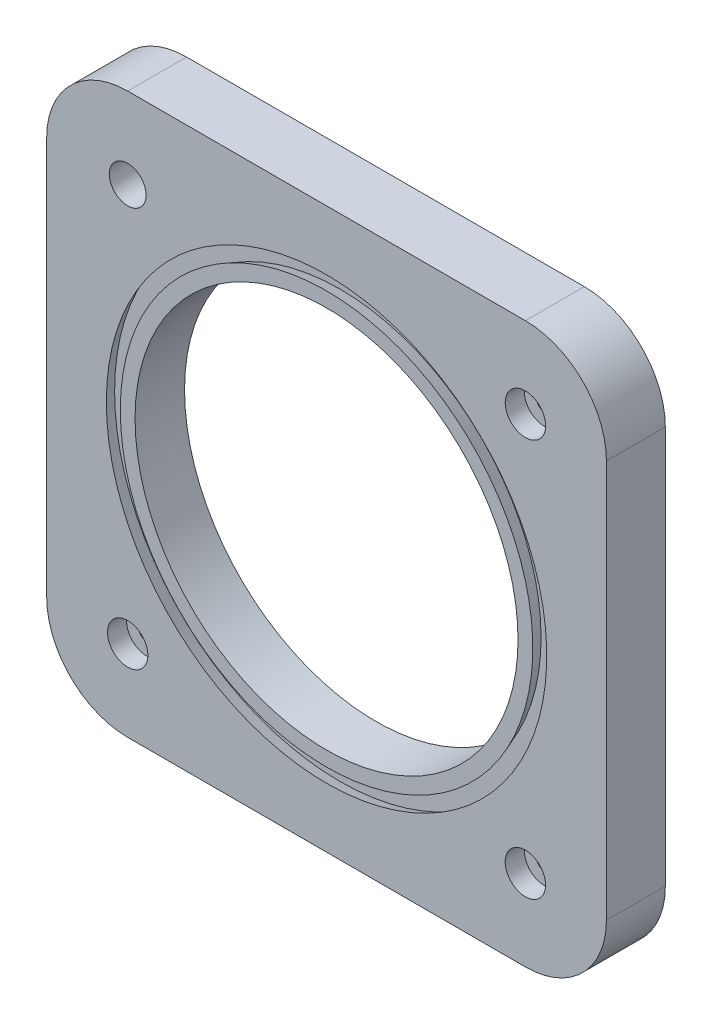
ISO-10303-21;
HEADER;
FILE_DESCRIPTION(('STEP AP214'),'2;1');
FILE_NAME('part.step','',(''),(''),'','','');
FILE_SCHEMA(('AUTOMOTIVE_DESIGN { 1 0 10303 214 1 1 1 1 }'));
ENDSEC;
DATA;
#1=APPLICATION_CONTEXT('core data for automotive mechanical design processes');
#2=APPLICATION_PROTOCOL_DEFINITION('international standard','automotive_design',2000,#1);
#3=PRODUCT_CONTEXT('',#1,'mechanical');
#4=PRODUCT('Part','Part','',(#3));
#5=PRODUCT_RELATED_PRODUCT_CATEGORY('part','',(#4));
#6=PRODUCT_DEFINITION_FORMATION('','',#4);
#7=PRODUCT_DEFINITION_CONTEXT('part definition',#1,'design');
#8=PRODUCT_DEFINITION('design','',#6,#7);
#9=PRODUCT_DEFINITION_SHAPE('','',#8);
#10=(LENGTH_UNIT() NAMED_UNIT(*) SI_UNIT(.MILLI.,.METRE.));
#11=(NAMED_UNIT(*) PLANE_ANGLE_UNIT() SI_UNIT($,.RADIAN.));
#12=(NAMED_UNIT(*) SI_UNIT($,.STERADIAN.) SOLID_ANGLE_UNIT());
#13=UNCERTAINTY_MEASURE_WITH_UNIT(LENGTH_MEASURE(1.E-05),#10,'distance_accuracy_value','');
#14=(GEOMETRIC_REPRESENTATION_CONTEXT(3) GLOBAL_UNCERTAINTY_ASSIGNED_CONTEXT((#13)) GLOBAL_UNIT_ASSIGNED_CONTEXT((#10,
#11,#12)) REPRESENTATION_CONTEXT('',''));
#15=CARTESIAN_POINT('',(0.,0.,0.));
#16=DIRECTION('',(0.,0.,1.));
#17=DIRECTION('',(1.,0.,0.));
#18=AXIS2_PLACEMENT_3D('',#15,#16,#17);
#19=CARTESIAN_POINT('',(0.,0.,25.4));
#20=DIRECTION('',(0.,0.,-1.));
#21=DIRECTION('',(-1.,0.,0.));
#22=AXIS2_PLACEMENT_3D('',#19,#20,#21);
#23=CYLINDRICAL_SURFACE('',#22,82.55);
#24=CARTESIAN_POINT('',(0.,0.,25.4));
#25=DIRECTION('',(0.,0.,1.));
#26=DIRECTION('',(1.,0.,0.));
#27=AXIS2_PLACEMENT_3D('',#24,#25,#26);
#28=CIRCLE('',#27,82.55);
#29=CARTESIAN_POINT('',(-82.55,0.,25.4));
#30=VERTEX_POINT('',#29);
#31=EDGE_CURVE('E122',#30,#30,#28,.T.);
#32=CARTESIAN_POINT('',(0.,0.,4.064));
#33=DIRECTION('',(0.,0.,-1.));
#34=DIRECTION('',(-1.,0.,0.));
#35=AXIS2_PLACEMENT_3D('',#32,#33,#34);
#36=CIRCLE('',#35,82.55);
#37=CARTESIAN_POINT('',(-82.55,0.,4.06400000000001));
#38=VERTEX_POINT('',#37);
#39=EDGE_CURVE('E38',#38,#38,#36,.T.);
#40=CARTESIAN_POINT('',(-82.55,0.,25.4));
#41=CARTESIAN_POINT('',(-82.55,0.,25.17775));
#42=CARTESIAN_POINT('',(-82.55,0.,24.9555));
#43=CARTESIAN_POINT('',(-82.55,0.,24.511));
#44=CARTESIAN_POINT('',(-82.55,0.,24.28875));
#45=CARTESIAN_POINT('',(-82.55,0.,23.84425));
#46=CARTESIAN_POINT('',(-82.55,0.,23.622));
#47=CARTESIAN_POINT('',(-82.55,0.,23.1775));
#48=CARTESIAN_POINT('',(-82.55,0.,22.95525));
#49=CARTESIAN_POINT('',(-82.55,0.,22.51075));
#50=CARTESIAN_POINT('',(-82.55,0.,22.2885));
#51=CARTESIAN_POINT('',(-82.55,0.,21.844));
#52=CARTESIAN_POINT('',(-82.55,0.,21.62175));
#53=CARTESIAN_POINT('',(-82.55,0.,21.17725));
#54=CARTESIAN_POINT('',(-82.55,0.,20.955));
#55=CARTESIAN_POINT('',(-82.55,0.,20.5105));
#56=CARTESIAN_POINT('',(-82.55,0.,20.28825));
#57=CARTESIAN_POINT('',(-82.55,0.,19.84375));
#58=CARTESIAN_POINT('',(-82.55,0.,19.6215));
#59=CARTESIAN_POINT('',(-82.55,0.,19.177));
#60=CARTESIAN_POINT('',(-82.55,0.,18.95475));
#61=CARTESIAN_POINT('',(-82.55,0.,18.51025));
#62=CARTESIAN_POINT('',(-82.55,0.,18.288));
#63=CARTESIAN_POINT('',(-82.55,0.,17.8435));
#64=CARTESIAN_POINT('',(-82.55,0.,17.62125));
#65=CARTESIAN_POINT('',(-82.55,0.,17.17675));
#66=CARTESIAN_POINT('',(-82.55,0.,16.9545));
#67=CARTESIAN_POINT('',(-82.55,0.,16.51));
#68=CARTESIAN_POINT('',(-82.55,0.,16.28775));
#69=CARTESIAN_POINT('',(-82.55,0.,15.84325));
#70=CARTESIAN_POINT('',(-82.55,0.,15.621));
#71=CARTESIAN_POINT('',(-82.55,0.,15.1765));
#72=CARTESIAN_POINT('',(-82.55,0.,14.95425));
#73=CARTESIAN_POINT('',(-82.55,0.,14.50975));
#74=CARTESIAN_POINT('',(-82.55,0.,14.2875));
#75=CARTESIAN_POINT('',(-82.55,0.,13.843));
#76=CARTESIAN_POINT('',(-82.55,0.,13.62075));
#77=CARTESIAN_POINT('',(-82.55,0.,13.17625));
#78=CARTESIAN_POINT('',(-82.55,0.,12.954));
#79=CARTESIAN_POINT('',(-82.55,0.,12.5095));
#80=CARTESIAN_POINT('',(-82.55,0.,12.28725));
#81=CARTESIAN_POINT('',(-82.55,0.,11.84275));
#82=CARTESIAN_POINT('',(-82.55,0.,11.6205));
#83=CARTESIAN_POINT('',(-82.55,0.,11.176));
#84=CARTESIAN_POINT('',(-82.55,0.,10.95375));
#85=CARTESIAN_POINT('',(-82.55,0.,10.50925));
#86=CARTESIAN_POINT('',(-82.55,0.,10.287));
#87=CARTESIAN_POINT('',(-82.55,0.,9.8425));
#88=CARTESIAN_POINT('',(-82.55,0.,9.62025));
#89=CARTESIAN_POINT('',(-82.55,0.,9.17575));
#90=CARTESIAN_POINT('',(-82.55,0.,8.9535));
#91=CARTESIAN_POINT('',(-82.55,0.,8.509));
#92=CARTESIAN_POINT('',(-82.55,0.,8.28675));
#93=CARTESIAN_POINT('',(-82.55,0.,7.84225000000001));
#94=CARTESIAN_POINT('',(-82.55,0.,7.62000000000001));
#95=CARTESIAN_POINT('',(-82.55,0.,7.1755));
#96=CARTESIAN_POINT('',(-82.55,0.,6.95325));
#97=CARTESIAN_POINT('',(-82.55,0.,6.50875));
#98=CARTESIAN_POINT('',(-82.55,0.,6.2865));
#99=CARTESIAN_POINT('',(-82.55,0.,5.842));
#100=CARTESIAN_POINT('',(-82.55,0.,5.61975000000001));
#101=CARTESIAN_POINT('',(-82.55,0.,5.17525000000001));
#102=CARTESIAN_POINT('',(-82.55,0.,4.95300000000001));
#103=CARTESIAN_POINT('',(-82.55,0.,4.50850000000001));
#104=CARTESIAN_POINT('',(-82.55,0.,4.28625000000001));
#105=CARTESIAN_POINT('',(-82.55,0.,4.06400000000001));
#106=B_SPLINE_CURVE_WITH_KNOTS('',3,(#40,#41,#42,#43,#44,#45,#46,#47,#48,#49,#50,#51,#52,#53,
#54,#55,#56,#57,#58,#59,#60,#61,#62,#63,#64,#65,#66,#67,#68,#69,#70,#71,#72,#73,#74,#75,#76,#77,
#78,#79,#80,#81,#82,#83,#84,#85,#86,#87,#88,#89,#90,#91,#92,#93,#94,#95,#96,#97,#98,#99,#100,
#101,#102,#103,#104,#105),.UNSPECIFIED.,.F.,.F.,(4,2,2,2,2,2,2,2,2,2,2,2,2,2,2,2,2,2,2,2,2,2,2,
2,2,2,2,2,2,2,2,2,4),(0.,0.666749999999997,1.3335,2.00025,2.667,3.33375,4.0005,4.66725,5.334,
6.00075,6.6675,7.33425,8.00099999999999,8.66774999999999,9.33449999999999,10.00125,10.668,
11.33475,12.0015,12.66825,13.335,14.00175,14.6685,15.33525,16.002,16.66875,17.3355,18.00225,
18.669,19.33575,20.0025,20.66925,21.336),.UNSPECIFIED.);
#107=EDGE_CURVE('BSEAM34',#30,#38,#106,.T.);
#108=ORIENTED_EDGE('',*,*,#31,.T.);
#109=ORIENTED_EDGE('',*,*,#39,.T.);
#110=ORIENTED_EDGE('',*,*,#107,.T.);
#111=ORIENTED_EDGE('',*,*,#107,.F.);
#112=EDGE_LOOP('',(#108,#110,#109,#111));
#113=FACE_BOUND('',#112,.T.);
#114=ADVANCED_FACE('F34',(#113),#23,.F.);
#115=CARTESIAN_POINT('',(-85.725,85.725,25.4));
#116=DIRECTION('',(0.,0.,-1.));
#117=DIRECTION('',(-1.,0.,0.));
#118=AXIS2_PLACEMENT_3D('',#115,#116,#117);
#119=PLANE('',#118);
#120=CARTESIAN_POINT('',(85.725,85.725,25.4));
#121=DIRECTION('',(0.,0.,-1.));
#122=DIRECTION('',(-1.,0.,0.));
#123=AXIS2_PLACEMENT_3D('',#120,#121,#122);
#124=CIRCLE('',#123,8.7122);
#125=CARTESIAN_POINT('',(77.0128,85.725,25.4));
#126=VERTEX_POINT('',#125);
#127=EDGE_CURVE('E196',#126,#126,#124,.T.);
#128=ORIENTED_EDGE('',*,*,#127,.T.);
#129=EDGE_LOOP('',(#128));
#130=FACE_BOUND('',#129,.T.);
#131=CARTESIAN_POINT('',(85.725,-85.725,25.4));
#132=DIRECTION('',(0.,0.,1.));
#133=DIRECTION('',(1.,0.,0.));
#134=AXIS2_PLACEMENT_3D('',#131,#132,#133);
#135=CIRCLE('',#134,8.7122);
#136=CARTESIAN_POINT('',(94.4372,-85.725,25.4));
#137=VERTEX_POINT('',#136);
#138=EDGE_CURVE('E192',#137,#137,#135,.T.);
#139=ORIENTED_EDGE('',*,*,#138,.F.);
#140=EDGE_LOOP('',(#139));
#141=FACE_BOUND('',#140,.T.);
#142=CARTESIAN_POINT('',(0.,0.,25.4));
#143=DIRECTION('',(0.,0.,-1.));
#144=DIRECTION('',(-1.,0.,0.));
#145=AXIS2_PLACEMENT_3D('',#142,#143,#144);
#146=CIRCLE('',#145,94.9325000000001);
#147=CARTESIAN_POINT('',(-94.9325000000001,0.,25.4));
#148=VERTEX_POINT('',#147);
#149=EDGE_CURVE('E173',#148,#148,#146,.T.);
#150=ORIENTED_EDGE('',*,*,#149,.T.);
#151=EDGE_LOOP('',(#150));
#152=FACE_BOUND('',#151,.T.);
#153=CARTESIAN_POINT('',(-85.725,85.725,25.4));
#154=DIRECTION('',(0.,0.,-1.));
#155=DIRECTION('',(-1.,0.,0.));
#156=AXIS2_PLACEMENT_3D('',#153,#154,#155);
#157=CIRCLE('',#156,34.925);
#158=CARTESIAN_POINT('',(-120.65,85.725,25.4));
#159=VERTEX_POINT('',#158);
#160=CARTESIAN_POINT('',(-85.725,120.65,25.4));
#161=VERTEX_POINT('',#160);
#162=EDGE_CURVE('E103',#159,#161,#157,.T.);
#163=ORIENTED_EDGE('',*,*,#162,.F.);
#164=DIRECTION('',(0.,-1.,0.));
#165=VECTOR('',#164,1.);
#166=CARTESIAN_POINT('',(-120.65,85.725,25.4));
#167=LINE('',#166,#165);
#168=CARTESIAN_POINT('',(-120.65,-85.725,25.4));
#169=VERTEX_POINT('',#168);
#170=EDGE_CURVE('E56',#159,#169,#167,.T.);
#171=ORIENTED_EDGE('',*,*,#170,.T.);
#172=CARTESIAN_POINT('',(-85.725,-85.725,25.4));
#173=DIRECTION('',(0.,0.,-1.));
#174=DIRECTION('',(-1.,0.,0.));
#175=AXIS2_PLACEMENT_3D('',#172,#173,#174);
#176=CIRCLE('',#175,34.925);
#177=CARTESIAN_POINT('',(-85.725,-120.65,25.4));
#178=VERTEX_POINT('',#177);
#179=EDGE_CURVE('E156',#178,#169,#176,.T.);
#180=ORIENTED_EDGE('',*,*,#179,.F.);
#181=DIRECTION('',(-1.,0.,0.));
#182=VECTOR('',#181,1.);
#183=CARTESIAN_POINT('',(85.725,-120.65,25.4));
#184=LINE('',#183,#182);
#185=CARTESIAN_POINT('',(85.725,-120.65,25.4));
#186=VERTEX_POINT('',#185);
#187=EDGE_CURVE('E153',#186,#178,#184,.T.);
#188=ORIENTED_EDGE('',*,*,#187,.F.);
#189=CARTESIAN_POINT('',(85.725,-85.725,25.4));
#190=DIRECTION('',(0.,0.,1.));
#191=DIRECTION('',(1.,0.,0.));
#192=AXIS2_PLACEMENT_3D('',#189,#190,#191);
#193=CIRCLE('',#192,34.925);
#194=CARTESIAN_POINT('',(120.65,-85.725,25.4));
#195=VERTEX_POINT('',#194);
#196=EDGE_CURVE('E151',#186,#195,#193,.T.);
#197=ORIENTED_EDGE('',*,*,#196,.T.);
#198=DIRECTION('',(0.,-1.,0.));
#199=VECTOR('',#198,1.);
#200=CARTESIAN_POINT('',(120.65,85.725,25.4));
#201=LINE('',#200,#199);
#202=CARTESIAN_POINT('',(120.65,85.725,25.4));
#203=VERTEX_POINT('',#202);
#204=EDGE_CURVE('E148',#203,#195,#201,.T.);
#205=ORIENTED_EDGE('',*,*,#204,.F.);
#206=CARTESIAN_POINT('',(85.725,85.725,25.4));
#207=DIRECTION('',(0.,0.,-1.));
#208=DIRECTION('',(-1.,0.,0.));
#209=AXIS2_PLACEMENT_3D('',#206,#207,#208);
#210=CIRCLE('',#209,34.925);
#211=CARTESIAN_POINT('',(85.725,120.65,25.4));
#212=VERTEX_POINT('',#211);
#213=EDGE_CURVE('E145',#212,#203,#210,.T.);
#214=ORIENTED_EDGE('',*,*,#213,.F.);
#215=DIRECTION('',(-1.,0.,0.));
#216=VECTOR('',#215,1.);
#217=CARTESIAN_POINT('',(85.725,120.65,25.4));
#218=LINE('',#217,#216);
#219=EDGE_CURVE('E143',#212,#161,#218,.T.);
#220=ORIENTED_EDGE('',*,*,#219,.T.);
#221=EDGE_LOOP('',(#163,#171,#180,#188,#197,#205,#214,#220));
#222=FACE_BOUND('',#221,.T.);
#223=CARTESIAN_POINT('',(-85.725,85.725,25.4));
#224=DIRECTION('',(0.,0.,1.));
#225=DIRECTION('',(1.,0.,0.));
#226=AXIS2_PLACEMENT_3D('',#223,#224,#225);
#227=CIRCLE('',#226,7.9375);
#228=CARTESIAN_POINT('',(-93.6625,85.725,25.4));
#229=VERTEX_POINT('',#228);
#230=EDGE_CURVE('E125',#229,#229,#227,.T.);
#231=ORIENTED_EDGE('',*,*,#230,.F.);
#232=EDGE_LOOP('',(#231));
#233=FACE_BOUND('',#232,.T.);
#234=CARTESIAN_POINT('',(-85.725,-85.725,25.4));
#235=DIRECTION('',(0.,0.,-1.));
#236=DIRECTION('',(-1.,0.,0.));
#237=AXIS2_PLACEMENT_3D('',#234,#235,#236);
#238=CIRCLE('',#237,8.7122);
#239=CARTESIAN_POINT('',(-94.4372,-85.725,25.4));
#240=VERTEX_POINT('',#239);
#241=EDGE_CURVE('E203',#240,#240,#238,.T.);
#242=ORIENTED_EDGE('',*,*,#241,.T.);
#243=EDGE_LOOP('',(#242));
#244=FACE_BOUND('',#243,.T.);
#245=ADVANCED_FACE('F248',(#130,#141,#152,#222,#233,#244),#119,.F.);
#246=CARTESIAN_POINT('',(85.725,-85.725,25.4));
#247=DIRECTION('',(0.,0.,-1.));
#248=DIRECTION('',(-1.,0.,0.));
#249=AXIS2_PLACEMENT_3D('',#246,#247,#248);
#250=CYLINDRICAL_SURFACE('',#249,3.36549999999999);
#251=CARTESIAN_POINT('',(85.725,-85.725,2.54));
#252=DIRECTION('',(0.,0.,1.));
#253=DIRECTION('',(1.,0.,0.));
#254=AXIS2_PLACEMENT_3D('',#251,#252,#253);
#255=CIRCLE('',#254,3.36549999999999);
#256=CARTESIAN_POINT('',(82.3595,-85.725,2.54));
#257=VERTEX_POINT('',#256);
#258=EDGE_CURVE('E175',#257,#257,#255,.F.);
#259=CARTESIAN_POINT('',(85.725,-85.725,17.145));
#260=DIRECTION('',(0.,0.,1.));
#261=DIRECTION('',(1.,0.,0.));
#262=AXIS2_PLACEMENT_3D('',#259,#260,#261);
#263=CIRCLE('',#262,3.36549999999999);
#264=CARTESIAN_POINT('',(82.3595,-85.725,17.145));
#265=VERTEX_POINT('',#264);
#266=EDGE_CURVE('E185',#265,#265,#263,.F.);
#267=CARTESIAN_POINT('',(82.3595,-85.725,2.54));
#268=CARTESIAN_POINT('',(82.3595,-85.725,2.69213541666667));
#269=CARTESIAN_POINT('',(82.3595,-85.725,2.84427083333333));
#270=CARTESIAN_POINT('',(82.3595,-85.725,3.14854166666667));
#271=CARTESIAN_POINT('',(82.3595,-85.725,3.30067708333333));
#272=CARTESIAN_POINT('',(82.3595,-85.725,3.60494791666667));
#273=CARTESIAN_POINT('',(82.3595,-85.725,3.75708333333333));
#274=CARTESIAN_POINT('',(82.3595,-85.725,4.06135416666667));
#275=CARTESIAN_POINT('',(82.3595,-85.725,4.21348958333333));
#276=CARTESIAN_POINT('',(82.3595,-85.725,4.51776041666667));
#277=CARTESIAN_POINT('',(82.3595,-85.725,4.66989583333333));
#278=CARTESIAN_POINT('',(82.3595,-85.725,4.97416666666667));
#279=CARTESIAN_POINT('',(82.3595,-85.725,5.12630208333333));
#280=CARTESIAN_POINT('',(82.3595,-85.725,5.43057291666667));
#281=CARTESIAN_POINT('',(82.3595,-85.725,5.58270833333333));
#282=CARTESIAN_POINT('',(82.3595,-85.725,5.88697916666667));
#283=CARTESIAN_POINT('',(82.3595,-85.725,6.03911458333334));
#284=CARTESIAN_POINT('',(82.3595,-85.725,6.34338541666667));
#285=CARTESIAN_POINT('',(82.3595,-85.725,6.49552083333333));
#286=CARTESIAN_POINT('',(82.3595,-85.725,6.79979166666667));
#287=CARTESIAN_POINT('',(82.3595,-85.725,6.95192708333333));
#288=CARTESIAN_POINT('',(82.3595,-85.725,7.25619791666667));
#289=CARTESIAN_POINT('',(82.3595,-85.725,7.40833333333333));
#290=CARTESIAN_POINT('',(82.3595,-85.725,7.71260416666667));
#291=CARTESIAN_POINT('',(82.3595,-85.725,7.86473958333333));
#292=CARTESIAN_POINT('',(82.3595,-85.725,8.16901041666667));
#293=CARTESIAN_POINT('',(82.3595,-85.725,8.32114583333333));
#294=CARTESIAN_POINT('',(82.3595,-85.725,8.62541666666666));
#295=CARTESIAN_POINT('',(82.3595,-85.725,8.77755208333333));
#296=CARTESIAN_POINT('',(82.3595,-85.725,9.08182291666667));
#297=CARTESIAN_POINT('',(82.3595,-85.725,9.23395833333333));
#298=CARTESIAN_POINT('',(82.3595,-85.725,9.53822916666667));
#299=CARTESIAN_POINT('',(82.3595,-85.725,9.69036458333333));
#300=CARTESIAN_POINT('',(82.3595,-85.725,9.99463541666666));
#301=CARTESIAN_POINT('',(82.3595,-85.725,10.1467708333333));
#302=CARTESIAN_POINT('',(82.3595,-85.725,10.4510416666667));
#303=CARTESIAN_POINT('',(82.3595,-85.725,10.6031770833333));
#304=CARTESIAN_POINT('',(82.3595,-85.725,10.9074479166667));
#305=CARTESIAN_POINT('',(82.3595,-85.725,11.0595833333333));
#306=CARTESIAN_POINT('',(82.3595,-85.725,11.3638541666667));
#307=CARTESIAN_POINT('',(82.3595,-85.725,11.5159895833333));
#308=CARTESIAN_POINT('',(82.3595,-85.725,11.8202604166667));
#309=CARTESIAN_POINT('',(82.3595,-85.725,11.9723958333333));
#310=CARTESIAN_POINT('',(82.3595,-85.725,12.2766666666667));
#311=CARTESIAN_POINT('',(82.3595,-85.725,12.4288020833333));
#312=CARTESIAN_POINT('',(82.3595,-85.725,12.7330729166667));
#313=CARTESIAN_POINT('',(82.3595,-85.725,12.8852083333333));
#314=CARTESIAN_POINT('',(82.3595,-85.725,13.1894791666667));
#315=CARTESIAN_POINT('',(82.3595,-85.725,13.3416145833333));
#316=CARTESIAN_POINT('',(82.3595,-85.725,13.6458854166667));
#317=CARTESIAN_POINT('',(82.3595,-85.725,13.7980208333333));
#318=CARTESIAN_POINT('',(82.3595,-85.725,14.1022916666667));
#319=CARTESIAN_POINT('',(82.3595,-85.725,14.2544270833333));
#320=CARTESIAN_POINT('',(82.3595,-85.725,14.5586979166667));
#321=CARTESIAN_POINT('',(82.3595,-85.725,14.7108333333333));
#322=CARTESIAN_POINT('',(82.3595,-85.725,15.0151041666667));
#323=CARTESIAN_POINT('',(82.3595,-85.725,15.1672395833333));
#324=CARTESIAN_POINT('',(82.3595,-85.725,15.4715104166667));
#325=CARTESIAN_POINT('',(82.3595,-85.725,15.6236458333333));
#326=CARTESIAN_POINT('',(82.3595,-85.725,15.9279166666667));
#327=CARTESIAN_POINT('',(82.3595,-85.725,16.0800520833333));
#328=CARTESIAN_POINT('',(82.3595,-85.725,16.3843229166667));
#329=CARTESIAN_POINT('',(82.3595,-85.725,16.5364583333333));
#330=CARTESIAN_POINT('',(82.3595,-85.725,16.8407291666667));
#331=CARTESIAN_POINT('',(82.3595,-85.725,16.9928645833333));
#332=CARTESIAN_POINT('',(82.3595,-85.725,17.145));
#333=B_SPLINE_CURVE_WITH_KNOTS('',3,(#267,#268,#269,#270,#271,#272,#273,#274,#275,#276,#277,
#278,#279,#280,#281,#282,#283,#284,#285,#286,#287,#288,#289,#290,#291,#292,#293,#294,#295,#296,
#297,#298,#299,#300,#301,#302,#303,#304,#305,#306,#307,#308,#309,#310,#311,#312,#313,#314,#315,
#316,#317,#318,#319,#320,#321,#322,#323,#324,#325,#326,#327,#328,#329,#330,#331,#332),
.UNSPECIFIED.,.F.,.F.,(4,2,2,2,2,2,2,2,2,2,2,2,2,2,2,2,2,2,2,2,2,2,2,2,2,2,2,2,2,2,2,2,4),(0.,
0.456406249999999,0.912812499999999,1.36921875,1.825625,2.28203125,2.7384375,3.19484375,3.65125,
4.10765625,4.5640625,5.02046875,5.476875,5.93328125,6.3896875,6.84609375,7.3025,7.75890625,
8.2153125,8.67171875,9.128125,9.58453125,10.0409375,10.49734375,10.95375,11.41015625,11.8665625,
12.32296875,12.779375,13.23578125,13.6921875,14.14859375,14.605),.UNSPECIFIED.);
#334=EDGE_CURVE('BSEAM251',#257,#265,#333,.T.);
#335=ORIENTED_EDGE('',*,*,#258,.T.);
#336=ORIENTED_EDGE('',*,*,#266,.F.);
#337=ORIENTED_EDGE('',*,*,#334,.T.);
#338=ORIENTED_EDGE('',*,*,#334,.F.);
#339=EDGE_LOOP('',(#335,#337,#336,#338));
#340=FACE_BOUND('',#339,.T.);
#341=ADVANCED_FACE('F251',(#340),#250,.F.);
#342=CARTESIAN_POINT('',(85.725,85.725,25.4));
#343=DIRECTION('',(0.,0.,-1.));
#344=DIRECTION('',(-1.,0.,0.));
#345=AXIS2_PLACEMENT_3D('',#342,#343,#344);
#346=CYLINDRICAL_SURFACE('',#345,3.36549999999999);
#347=CARTESIAN_POINT('',(85.725,85.725,17.145));
#348=DIRECTION('',(0.,0.,-1.));
#349=DIRECTION('',(-1.,0.,0.));
#350=AXIS2_PLACEMENT_3D('',#347,#348,#349);
#351=CIRCLE('',#350,3.36549999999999);
#352=CARTESIAN_POINT('',(82.3595,85.725,17.145));
#353=VERTEX_POINT('',#352);
#354=EDGE_CURVE('E190',#353,#353,#351,.T.);
#355=CARTESIAN_POINT('',(85.725,85.725,2.54));
#356=DIRECTION('',(0.,0.,-1.));
#357=DIRECTION('',(-1.,0.,0.));
#358=AXIS2_PLACEMENT_3D('',#355,#356,#357);
#359=CIRCLE('',#358,3.36549999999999);
#360=CARTESIAN_POINT('',(82.3595,85.725,2.54));
#361=VERTEX_POINT('',#360);
#362=EDGE_CURVE('E180',#361,#361,#359,.T.);
#363=CARTESIAN_POINT('',(82.3595,85.725,17.145));
#364=CARTESIAN_POINT('',(82.3595,85.725,16.9928645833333));
#365=CARTESIAN_POINT('',(82.3595,85.725,16.8407291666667));
#366=CARTESIAN_POINT('',(82.3595,85.725,16.5364583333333));
#367=CARTESIAN_POINT('',(82.3595,85.725,16.3843229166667));
#368=CARTESIAN_POINT('',(82.3595,85.725,16.0800520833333));
#369=CARTESIAN_POINT('',(82.3595,85.725,15.9279166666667));
#370=CARTESIAN_POINT('',(82.3595,85.725,15.6236458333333));
#371=CARTESIAN_POINT('',(82.3595,85.725,15.4715104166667));
#372=CARTESIAN_POINT('',(82.3595,85.725,15.1672395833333));
#373=CARTESIAN_POINT('',(82.3595,85.725,15.0151041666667));
#374=CARTESIAN_POINT('',(82.3595,85.725,14.7108333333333));
#375=CARTESIAN_POINT('',(82.3595,85.725,14.5586979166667));
#376=CARTESIAN_POINT('',(82.3595,85.725,14.2544270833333));
#377=CARTESIAN_POINT('',(82.3595,85.725,14.1022916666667));
#378=CARTESIAN_POINT('',(82.3595,85.725,13.7980208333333));
#379=CARTESIAN_POINT('',(82.3595,85.725,13.6458854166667));
#380=CARTESIAN_POINT('',(82.3595,85.725,13.3416145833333));
#381=CARTESIAN_POINT('',(82.3595,85.725,13.1894791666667));
#382=CARTESIAN_POINT('',(82.3595,85.725,12.8852083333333));
#383=CARTESIAN_POINT('',(82.3595,85.725,12.7330729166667));
#384=CARTESIAN_POINT('',(82.3595,85.725,12.4288020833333));
#385=CARTESIAN_POINT('',(82.3595,85.725,12.2766666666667));
#386=CARTESIAN_POINT('',(82.3595,85.725,11.9723958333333));
#387=CARTESIAN_POINT('',(82.3595,85.725,11.8202604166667));
#388=CARTESIAN_POINT('',(82.3595,85.725,11.5159895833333));
#389=CARTESIAN_POINT('',(82.3595,85.725,11.3638541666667));
#390=CARTESIAN_POINT('',(82.3595,85.725,11.0595833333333));
#391=CARTESIAN_POINT('',(82.3595,85.725,10.9074479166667));
#392=CARTESIAN_POINT('',(82.3595,85.725,10.6031770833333));
#393=CARTESIAN_POINT('',(82.3595,85.725,10.4510416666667));
#394=CARTESIAN_POINT('',(82.3595,85.725,10.1467708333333));
#395=CARTESIAN_POINT('',(82.3595,85.725,9.99463541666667));
#396=CARTESIAN_POINT('',(82.3595,85.725,9.69036458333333));
#397=CARTESIAN_POINT('',(82.3595,85.725,9.53822916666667));
#398=CARTESIAN_POINT('',(82.3595,85.725,9.23395833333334));
#399=CARTESIAN_POINT('',(82.3595,85.725,9.08182291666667));
#400=CARTESIAN_POINT('',(82.3595,85.725,8.77755208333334));
#401=CARTESIAN_POINT('',(82.3595,85.725,8.62541666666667));
#402=CARTESIAN_POINT('',(82.3595,85.725,8.32114583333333));
#403=CARTESIAN_POINT('',(82.3595,85.725,8.16901041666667));
#404=CARTESIAN_POINT('',(82.3595,85.725,7.86473958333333));
#405=CARTESIAN_POINT('',(82.3595,85.725,7.71260416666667));
#406=CARTESIAN_POINT('',(82.3595,85.725,7.40833333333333));
#407=CARTESIAN_POINT('',(82.3595,85.725,7.25619791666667));
#408=CARTESIAN_POINT('',(82.3595,85.725,6.95192708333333));
#409=CARTESIAN_POINT('',(82.3595,85.725,6.79979166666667));
#410=CARTESIAN_POINT('',(82.3595,85.725,6.49552083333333));
#411=CARTESIAN_POINT('',(82.3595,85.725,6.34338541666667));
#412=CARTESIAN_POINT('',(82.3595,85.725,6.03911458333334));
#413=CARTESIAN_POINT('',(82.3595,85.725,5.88697916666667));
#414=CARTESIAN_POINT('',(82.3595,85.725,5.58270833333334));
#415=CARTESIAN_POINT('',(82.3595,85.725,5.43057291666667));
#416=CARTESIAN_POINT('',(82.3595,85.725,5.12630208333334));
#417=CARTESIAN_POINT('',(82.3595,85.725,4.97416666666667));
#418=CARTESIAN_POINT('',(82.3595,85.725,4.66989583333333));
#419=CARTESIAN_POINT('',(82.3595,85.725,4.51776041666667));
#420=CARTESIAN_POINT('',(82.3595,85.725,4.21348958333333));
#421=CARTESIAN_POINT('',(82.3595,85.725,4.06135416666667));
#422=CARTESIAN_POINT('',(82.3595,85.725,3.75708333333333));
#423=CARTESIAN_POINT('',(82.3595,85.725,3.60494791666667));
#424=CARTESIAN_POINT('',(82.3595,85.725,3.30067708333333));
#425=CARTESIAN_POINT('',(82.3595,85.725,3.14854166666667));
#426=CARTESIAN_POINT('',(82.3595,85.725,2.84427083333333));
#427=CARTESIAN_POINT('',(82.3595,85.725,2.69213541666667));
#428=CARTESIAN_POINT('',(82.3595,85.725,2.54));
#429=B_SPLINE_CURVE_WITH_KNOTS('',3,(#363,#364,#365,#366,#367,#368,#369,#370,#371,#372,#373,
#374,#375,#376,#377,#378,#379,#380,#381,#382,#383,#384,#385,#386,#387,#388,#389,#390,#391,#392,
#393,#394,#395,#396,#397,#398,#399,#400,#401,#402,#403,#404,#405,#406,#407,#408,#409,#410,#411,
#412,#413,#414,#415,#416,#417,#418,#419,#420,#421,#422,#423,#424,#425,#426,#427,#428),
.UNSPECIFIED.,.F.,.F.,(4,2,2,2,2,2,2,2,2,2,2,2,2,2,2,2,2,2,2,2,2,2,2,2,2,2,2,2,2,2,2,2,4),(0.,
0.456406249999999,0.912812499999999,1.36921875,1.825625,2.28203125,2.7384375,3.19484375,3.65125,
4.10765625,4.5640625,5.02046875,5.476875,5.93328125,6.3896875,6.84609375,7.3025,7.75890625,
8.2153125,8.67171875,9.128125,9.58453125,10.0409375,10.49734375,10.95375,11.41015625,11.8665625,
12.32296875,12.779375,13.23578125,13.6921875,14.14859375,14.605),.UNSPECIFIED.);
#430=EDGE_CURVE('BSEAM282',#353,#361,#429,.T.);
#431=ORIENTED_EDGE('',*,*,#354,.F.);
#432=ORIENTED_EDGE('',*,*,#362,.T.);
#433=ORIENTED_EDGE('',*,*,#430,.T.);
#434=ORIENTED_EDGE('',*,*,#430,.F.);
#435=EDGE_LOOP('',(#431,#433,#432,#434));
#436=FACE_BOUND('',#435,.T.);
#437=ADVANCED_FACE('F282',(#436),#346,.F.);
#438=CARTESIAN_POINT('',(-85.725,85.725,0.));
#439=DIRECTION('',(0.,0.,-1.));
#440=DIRECTION('',(-1.,0.,0.));
#441=AXIS2_PLACEMENT_3D('',#438,#439,#440);
#442=PLANE('',#441);
#443=CARTESIAN_POINT('',(0.,0.,0.));
#444=DIRECTION('',(0.,0.,-1.));
#445=DIRECTION('',(-1.,0.,0.));
#446=AXIS2_PLACEMENT_3D('',#443,#444,#445);
#447=CIRCLE('',#446,95.5675);
#448=CARTESIAN_POINT('',(-95.5675,0.,0.));
#449=VERTEX_POINT('',#448);
#450=EDGE_CURVE('E518',#449,#449,#447,.T.);
#451=ORIENTED_EDGE('',*,*,#450,.F.);
#452=EDGE_LOOP('',(#451));
#453=FACE_BOUND('',#452,.T.);
#454=CARTESIAN_POINT('',(85.725,85.725,0.));
#455=DIRECTION('',(0.,0.,-1.));
#456=DIRECTION('',(-1.,0.,0.));
#457=AXIS2_PLACEMENT_3D('',#454,#455,#456);
#458=CIRCLE('',#457,6.477);
#459=CARTESIAN_POINT('',(79.248,85.725,0.));
#460=VERTEX_POINT('',#459);
#461=EDGE_CURVE('E188',#460,#460,#458,.T.);
#462=ORIENTED_EDGE('',*,*,#461,.F.);
#463=EDGE_LOOP('',(#462));
#464=FACE_BOUND('',#463,.T.);
#465=CARTESIAN_POINT('',(-85.725,85.725,0.));
#466=DIRECTION('',(0.,0.,1.));
#467=DIRECTION('',(1.,0.,0.));
#468=AXIS2_PLACEMENT_3D('',#465,#466,#467);
#469=CIRCLE('',#468,7.9375);
#470=CARTESIAN_POINT('',(-93.6625,85.725,0.));
#471=VERTEX_POINT('',#470);
#472=EDGE_CURVE('E240',#471,#471,#469,.T.);
#473=ORIENTED_EDGE('',*,*,#472,.T.);
#474=EDGE_LOOP('',(#473));
#475=FACE_BOUND('',#474,.T.);
#476=CARTESIAN_POINT('',(-85.725,85.725,0.));
#477=DIRECTION('',(0.,0.,-1.));
#478=DIRECTION('',(-1.,0.,0.));
#479=AXIS2_PLACEMENT_3D('',#476,#477,#478);
#480=CIRCLE('',#479,34.925);
#481=CARTESIAN_POINT('',(-120.65,85.725,0.));
#482=VERTEX_POINT('',#481);
#483=CARTESIAN_POINT('',(-85.725,120.65,0.));
#484=VERTEX_POINT('',#483);
#485=EDGE_CURVE('E102',#482,#484,#480,.T.);
#486=ORIENTED_EDGE('',*,*,#485,.T.);
#487=DIRECTION('',(-1.,0.,0.));
#488=VECTOR('',#487,1.);
#489=CARTESIAN_POINT('',(85.725,120.65,0.));
#490=LINE('',#489,#488);
#491=CARTESIAN_POINT('',(85.725,120.65,0.));
#492=VERTEX_POINT('',#491);
#493=EDGE_CURVE('E109',#492,#484,#490,.T.);
#494=ORIENTED_EDGE('',*,*,#493,.F.);
#495=CARTESIAN_POINT('',(85.725,85.725,0.));
#496=DIRECTION('',(0.,0.,-1.));
#497=DIRECTION('',(-1.,0.,0.));
#498=AXIS2_PLACEMENT_3D('',#495,#496,#497);
#499=CIRCLE('',#498,34.925);
#500=CARTESIAN_POINT('',(120.65,85.725,0.));
#501=VERTEX_POINT('',#500);
#502=EDGE_CURVE('E114',#492,#501,#499,.T.);
#503=ORIENTED_EDGE('',*,*,#502,.T.);
#504=DIRECTION('',(0.,-1.,0.));
#505=VECTOR('',#504,1.);
#506=CARTESIAN_POINT('',(120.65,85.725,0.));
#507=LINE('',#506,#505);
#508=CARTESIAN_POINT('',(120.65,-85.725,0.));
#509=VERTEX_POINT('',#508);
#510=EDGE_CURVE('E130',#501,#509,#507,.T.);
#511=ORIENTED_EDGE('',*,*,#510,.T.);
#512=CARTESIAN_POINT('',(85.725,-85.725,0.));
#513=DIRECTION('',(0.,0.,1.));
#514=DIRECTION('',(1.,0.,0.));
#515=AXIS2_PLACEMENT_3D('',#512,#513,#514);
#516=CIRCLE('',#515,34.925);
#517=CARTESIAN_POINT('',(85.725,-120.65,0.));
#518=VERTEX_POINT('',#517);
#519=EDGE_CURVE('E133',#518,#509,#516,.T.);
#520=ORIENTED_EDGE('',*,*,#519,.F.);
#521=DIRECTION('',(-1.,0.,0.));
#522=VECTOR('',#521,1.);
#523=CARTESIAN_POINT('',(85.725,-120.65,0.));
#524=LINE('',#523,#522);
#525=CARTESIAN_POINT('',(-85.725,-120.65,0.));
#526=VERTEX_POINT('',#525);
#527=EDGE_CURVE('E136',#518,#526,#524,.T.);
#528=ORIENTED_EDGE('',*,*,#527,.T.);
#529=CARTESIAN_POINT('',(-85.725,-85.725,0.));
#530=DIRECTION('',(0.,0.,-1.));
#531=DIRECTION('',(-1.,0.,0.));
#532=AXIS2_PLACEMENT_3D('',#529,#530,#531);
#533=CIRCLE('',#532,34.925);
#534=CARTESIAN_POINT('',(-120.65,-85.725,0.));
#535=VERTEX_POINT('',#534);
#536=EDGE_CURVE('E139',#526,#535,#533,.T.);
#537=ORIENTED_EDGE('',*,*,#536,.T.);
#538=DIRECTION('',(0.,-1.,0.));
#539=VECTOR('',#538,1.);
#540=CARTESIAN_POINT('',(-120.65,85.725,0.));
#541=LINE('',#540,#539);
#542=EDGE_CURVE('E121',#482,#535,#541,.T.);
#543=ORIENTED_EDGE('',*,*,#542,.F.);
#544=EDGE_LOOP('',(#486,#494,#503,#511,#520,#528,#537,#543));
#545=FACE_BOUND('',#544,.T.);
#546=CARTESIAN_POINT('',(-85.725,-85.725,0.));
#547=DIRECTION('',(0.,0.,-1.));
#548=DIRECTION('',(-1.,0.,0.));
#549=AXIS2_PLACEMENT_3D('',#546,#547,#548);
#550=CIRCLE('',#549,6.477);
#551=CARTESIAN_POINT('',(-92.202,-85.725,0.));
#552=VERTEX_POINT('',#551);
#553=EDGE_CURVE('E178',#552,#552,#550,.T.);
#554=ORIENTED_EDGE('',*,*,#553,.F.);
#555=EDGE_LOOP('',(#554));
#556=FACE_BOUND('',#555,.T.);
#557=CARTESIAN_POINT('',(85.725,-85.725,0.));
#558=DIRECTION('',(0.,0.,1.));
#559=DIRECTION('',(1.,0.,0.));
#560=AXIS2_PLACEMENT_3D('',#557,#558,#559);
#561=CIRCLE('',#560,6.477);
#562=CARTESIAN_POINT('',(92.202,-85.725,0.));
#563=VERTEX_POINT('',#562);
#564=EDGE_CURVE('E183',#563,#563,#561,.T.);
#565=ORIENTED_EDGE('',*,*,#564,.T.);
#566=EDGE_LOOP('',(#565));
#567=FACE_BOUND('',#566,.T.);
#568=ADVANCED_FACE('F117',(#453,#464,#475,#545,#556,#567),#442,.T.);
#569=CARTESIAN_POINT('',(-85.725,-85.725,25.4));
#570=DIRECTION('',(0.,0.,-1.));
#571=DIRECTION('',(-1.,0.,0.));
#572=AXIS2_PLACEMENT_3D('',#569,#570,#571);
#573=CYLINDRICAL_SURFACE('',#572,3.36549999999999);
#574=CARTESIAN_POINT('',(-85.725,-85.725,17.145));
#575=DIRECTION('',(0.,0.,-1.));
#576=DIRECTION('',(-1.,0.,0.));
#577=AXIS2_PLACEMENT_3D('',#574,#575,#576);
#578=CIRCLE('',#577,3.36549999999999);
#579=CARTESIAN_POINT('',(-89.0905,-85.725,17.145));
#580=VERTEX_POINT('',#579);
#581=EDGE_CURVE('E194',#580,#580,#578,.T.);
#582=CARTESIAN_POINT('',(-85.725,-85.725,2.54));
#583=DIRECTION('',(0.,0.,-1.));
#584=DIRECTION('',(-1.,0.,0.));
#585=AXIS2_PLACEMENT_3D('',#582,#583,#584);
#586=CIRCLE('',#585,3.36549999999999);
#587=CARTESIAN_POINT('',(-89.0905,-85.725,2.54));
#588=VERTEX_POINT('',#587);
#589=EDGE_CURVE('E170',#588,#588,#586,.T.);
#590=CARTESIAN_POINT('',(-89.0905,-85.725,17.145));
#591=CARTESIAN_POINT('',(-89.0905,-85.725,16.9928645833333));
#592=CARTESIAN_POINT('',(-89.0905,-85.725,16.8407291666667));
#593=CARTESIAN_POINT('',(-89.0905,-85.725,16.5364583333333));
#594=CARTESIAN_POINT('',(-89.0905,-85.725,16.3843229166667));
#595=CARTESIAN_POINT('',(-89.0905,-85.725,16.0800520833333));
#596=CARTESIAN_POINT('',(-89.0905,-85.725,15.9279166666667));
#597=CARTESIAN_POINT('',(-89.0905,-85.725,15.6236458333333));
#598=CARTESIAN_POINT('',(-89.0905,-85.725,15.4715104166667));
#599=CARTESIAN_POINT('',(-89.0905,-85.725,15.1672395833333));
#600=CARTESIAN_POINT('',(-89.0905,-85.725,15.0151041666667));
#601=CARTESIAN_POINT('',(-89.0905,-85.725,14.7108333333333));
#602=CARTESIAN_POINT('',(-89.0905,-85.725,14.5586979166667));
#603=CARTESIAN_POINT('',(-89.0905,-85.725,14.2544270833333));
#604=CARTESIAN_POINT('',(-89.0905,-85.725,14.1022916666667));
#605=CARTESIAN_POINT('',(-89.0905,-85.725,13.7980208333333));
#606=CARTESIAN_POINT('',(-89.0905,-85.725,13.6458854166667));
#607=CARTESIAN_POINT('',(-89.0905,-85.725,13.3416145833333));
#608=CARTESIAN_POINT('',(-89.0905,-85.725,13.1894791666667));
#609=CARTESIAN_POINT('',(-89.0905,-85.725,12.8852083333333));
#610=CARTESIAN_POINT('',(-89.0905,-85.725,12.7330729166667));
#611=CARTESIAN_POINT('',(-89.0905,-85.725,12.4288020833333));
#612=CARTESIAN_POINT('',(-89.0905,-85.725,12.2766666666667));
#613=CARTESIAN_POINT('',(-89.0905,-85.725,11.9723958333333));
#614=CARTESIAN_POINT('',(-89.0905,-85.725,11.8202604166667));
#615=CARTESIAN_POINT('',(-89.0905,-85.725,11.5159895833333));
#616=CARTESIAN_POINT('',(-89.0905,-85.725,11.3638541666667));
#617=CARTESIAN_POINT('',(-89.0905,-85.725,11.0595833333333));
#618=CARTESIAN_POINT('',(-89.0905,-85.725,10.9074479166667));
#619=CARTESIAN_POINT('',(-89.0905,-85.725,10.6031770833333));
#620=CARTESIAN_POINT('',(-89.0905,-85.725,10.4510416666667));
#621=CARTESIAN_POINT('',(-89.0905,-85.725,10.1467708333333));
#622=CARTESIAN_POINT('',(-89.0905,-85.725,9.99463541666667));
#623=CARTESIAN_POINT('',(-89.0905,-85.725,9.69036458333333));
#624=CARTESIAN_POINT('',(-89.0905,-85.725,9.53822916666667));
#625=CARTESIAN_POINT('',(-89.0905,-85.725,9.23395833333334));
#626=CARTESIAN_POINT('',(-89.0905,-85.725,9.08182291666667));
#627=CARTESIAN_POINT('',(-89.0905,-85.725,8.77755208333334));
#628=CARTESIAN_POINT('',(-89.0905,-85.725,8.62541666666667));
#629=CARTESIAN_POINT('',(-89.0905,-85.725,8.32114583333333));
#630=CARTESIAN_POINT('',(-89.0905,-85.725,8.16901041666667));
#631=CARTESIAN_POINT('',(-89.0905,-85.725,7.86473958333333));
#632=CARTESIAN_POINT('',(-89.0905,-85.725,7.71260416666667));
#633=CARTESIAN_POINT('',(-89.0905,-85.725,7.40833333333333));
#634=CARTESIAN_POINT('',(-89.0905,-85.725,7.25619791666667));
#635=CARTESIAN_POINT('',(-89.0905,-85.725,6.95192708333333));
#636=CARTESIAN_POINT('',(-89.0905,-85.725,6.79979166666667));
#637=CARTESIAN_POINT('',(-89.0905,-85.725,6.49552083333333));
#638=CARTESIAN_POINT('',(-89.0905,-85.725,6.34338541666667));
#639=CARTESIAN_POINT('',(-89.0905,-85.725,6.03911458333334));
#640=CARTESIAN_POINT('',(-89.0905,-85.725,5.88697916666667));
#641=CARTESIAN_POINT('',(-89.0905,-85.725,5.58270833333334));
#642=CARTESIAN_POINT('',(-89.0905,-85.725,5.43057291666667));
#643=CARTESIAN_POINT('',(-89.0905,-85.725,5.12630208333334));
#644=CARTESIAN_POINT('',(-89.0905,-85.725,4.97416666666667));
#645=CARTESIAN_POINT('',(-89.0905,-85.725,4.66989583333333));
#646=CARTESIAN_POINT('',(-89.0905,-85.725,4.51776041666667));
#647=CARTESIAN_POINT('',(-89.0905,-85.725,4.21348958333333));
#648=CARTESIAN_POINT('',(-89.0905,-85.725,4.06135416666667));
#649=CARTESIAN_POINT('',(-89.0905,-85.725,3.75708333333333));
#650=CARTESIAN_POINT('',(-89.0905,-85.725,3.60494791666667));
#651=CARTESIAN_POINT('',(-89.0905,-85.725,3.30067708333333));
#652=CARTESIAN_POINT('',(-89.0905,-85.725,3.14854166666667));
#653=CARTESIAN_POINT('',(-89.0905,-85.725,2.84427083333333));
#654=CARTESIAN_POINT('',(-89.0905,-85.725,2.69213541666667));
#655=CARTESIAN_POINT('',(-89.0905,-85.725,2.54));
#656=B_SPLINE_CURVE_WITH_KNOTS('',3,(#590,#591,#592,#593,#594,#595,#596,#597,#598,#599,#600,
#601,#602,#603,#604,#605,#606,#607,#608,#609,#610,#611,#612,#613,#614,#615,#616,#617,#618,#619,
#620,#621,#622,#623,#624,#625,#626,#627,#628,#629,#630,#631,#632,#633,#634,#635,#636,#637,#638,
#639,#640,#641,#642,#643,#644,#645,#646,#647,#648,#649,#650,#651,#652,#653,#654,#655),
.UNSPECIFIED.,.F.,.F.,(4,2,2,2,2,2,2,2,2,2,2,2,2,2,2,2,2,2,2,2,2,2,2,2,2,2,2,2,2,2,2,2,4),(0.,
0.456406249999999,0.912812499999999,1.36921875,1.825625,2.28203125,2.7384375,3.19484375,3.65125,
4.10765625,4.5640625,5.02046875,5.476875,5.93328125,6.3896875,6.84609375,7.3025,7.75890625,
8.2153125,8.67171875,9.128125,9.58453125,10.0409375,10.49734375,10.95375,11.41015625,11.8665625,
12.32296875,12.779375,13.23578125,13.6921875,14.14859375,14.605),.UNSPECIFIED.);
#657=EDGE_CURVE('BSEAM279',#580,#588,#656,.T.);
#658=ORIENTED_EDGE('',*,*,#581,.F.);
#659=ORIENTED_EDGE('',*,*,#589,.T.);
#660=ORIENTED_EDGE('',*,*,#657,.T.);
#661=ORIENTED_EDGE('',*,*,#657,.F.);
#662=EDGE_LOOP('',(#658,#660,#659,#661));
#663=FACE_BOUND('',#662,.T.);
#664=ADVANCED_FACE('F279',(#663),#573,.F.);
#665=ORIENTED_EDGE('',*,*,#31,.F.);
#666=EDGE_LOOP('',(#665));
#667=FACE_BOUND('',#666,.T.);
#668=CARTESIAN_POINT('',(0.,0.,25.4));
#669=DIRECTION('',(0.,0.,-1.));
#670=DIRECTION('',(-1.,0.,0.));
#671=AXIS2_PLACEMENT_3D('',#668,#669,#670);
#672=CIRCLE('',#671,88.9127000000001);
#673=CARTESIAN_POINT('',(-88.9127000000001,0.,25.4));
#674=VERTEX_POINT('',#673);
#675=EDGE_CURVE('E237',#674,#674,#672,.T.);
#676=ORIENTED_EDGE('',*,*,#675,.F.);
#677=EDGE_LOOP('',(#676));
#678=FACE_BOUND('',#677,.T.);
#679=ADVANCED_FACE('F254',(#667,#678),#119,.F.);
#680=CARTESIAN_POINT('',(-85.725,85.725,25.4));
#681=DIRECTION('',(0.,0.,-1.));
#682=DIRECTION('',(-1.,0.,0.));
#683=AXIS2_PLACEMENT_3D('',#680,#681,#682);
#684=CYLINDRICAL_SURFACE('',#683,34.925);
#685=ORIENTED_EDGE('',*,*,#485,.F.);
#686=DIRECTION('',(0.,0.,-1.));
#687=VECTOR('',#686,1.);
#688=CARTESIAN_POINT('',(-120.65,85.725,25.4));
#689=LINE('',#688,#687);
#690=EDGE_CURVE('E11',#159,#482,#689,.T.);
#691=ORIENTED_EDGE('',*,*,#690,.F.);
#692=ORIENTED_EDGE('',*,*,#162,.T.);
#693=DIRECTION('',(0.,0.,-1.));
#694=VECTOR('',#693,1.);
#695=CARTESIAN_POINT('',(-85.725,120.65,25.4));
#696=LINE('',#695,#694);
#697=EDGE_CURVE('E99',#161,#484,#696,.T.);
#698=ORIENTED_EDGE('',*,*,#697,.T.);
#699=EDGE_LOOP('',(#685,#691,#692,#698));
#700=FACE_BOUND('',#699,.T.);
#701=ADVANCED_FACE('F36',(#700),#684,.T.);
#702=CARTESIAN_POINT('',(-120.65,85.725,25.4));
#703=DIRECTION('',(1.,0.,0.));
#704=DIRECTION('',(0.,0.,-1.));
#705=AXIS2_PLACEMENT_3D('',#702,#703,#704);
#706=PLANE('',#705);
#707=ORIENTED_EDGE('',*,*,#542,.T.);
#708=DIRECTION('',(0.,0.,-1.));
#709=VECTOR('',#708,1.);
#710=CARTESIAN_POINT('',(-120.65,-85.725,25.4));
#711=LINE('',#710,#709);
#712=EDGE_CURVE('E43',#169,#535,#711,.T.);
#713=ORIENTED_EDGE('',*,*,#712,.F.);
#714=ORIENTED_EDGE('',*,*,#170,.F.);
#715=ORIENTED_EDGE('',*,*,#690,.T.);
#716=EDGE_LOOP('',(#707,#713,#714,#715));
#717=FACE_BOUND('',#716,.T.);
#718=ADVANCED_FACE('F285',(#717),#706,.F.);
#719=CARTESIAN_POINT('',(-85.725,-85.725,25.4));
#720=DIRECTION('',(0.,0.,-1.));
#721=DIRECTION('',(-1.,0.,0.));
#722=AXIS2_PLACEMENT_3D('',#719,#720,#721);
#723=CYLINDRICAL_SURFACE('',#722,34.925);
#724=ORIENTED_EDGE('',*,*,#536,.F.);
#725=DIRECTION('',(0.,0.,-1.));
#726=VECTOR('',#725,1.);
#727=CARTESIAN_POINT('',(-85.725,-120.65,25.4));
#728=LINE('',#727,#726);
#729=EDGE_CURVE('E161',#178,#526,#728,.T.);
#730=ORIENTED_EDGE('',*,*,#729,.F.);
#731=ORIENTED_EDGE('',*,*,#179,.T.);
#732=ORIENTED_EDGE('',*,*,#712,.T.);
#733=EDGE_LOOP('',(#724,#730,#731,#732));
#734=FACE_BOUND('',#733,.T.);
#735=ADVANCED_FACE('F288',(#734),#723,.T.);
#736=CARTESIAN_POINT('',(85.725,-120.65,25.4));
#737=DIRECTION('',(0.,-1.,0.));
#738=DIRECTION('',(1.,0.,0.));
#739=AXIS2_PLACEMENT_3D('',#736,#737,#738);
#740=PLANE('',#739);
#741=ORIENTED_EDGE('',*,*,#527,.F.);
#742=DIRECTION('',(0.,0.,-1.));
#743=VECTOR('',#742,1.);
#744=CARTESIAN_POINT('',(85.725,-120.65,25.4));
#745=LINE('',#744,#743);
#746=EDGE_CURVE('E163',#186,#518,#745,.T.);
#747=ORIENTED_EDGE('',*,*,#746,.F.);
#748=ORIENTED_EDGE('',*,*,#187,.T.);
#749=ORIENTED_EDGE('',*,*,#729,.T.);
#750=EDGE_LOOP('',(#741,#747,#748,#749));
#751=FACE_BOUND('',#750,.T.);
#752=ADVANCED_FACE('F292',(#751),#740,.T.);
#753=CARTESIAN_POINT('',(85.725,-85.725,25.4));
#754=DIRECTION('',(0.,0.,-1.));
#755=DIRECTION('',(-1.,0.,0.));
#756=AXIS2_PLACEMENT_3D('',#753,#754,#755);
#757=CYLINDRICAL_SURFACE('',#756,34.925);
#758=ORIENTED_EDGE('',*,*,#519,.T.);
#759=DIRECTION('',(0.,0.,-1.));
#760=VECTOR('',#759,1.);
#761=CARTESIAN_POINT('',(120.65,-85.725,25.4));
#762=LINE('',#761,#760);
#763=EDGE_CURVE('E165',#195,#509,#762,.T.);
#764=ORIENTED_EDGE('',*,*,#763,.F.);
#765=ORIENTED_EDGE('',*,*,#196,.F.);
#766=ORIENTED_EDGE('',*,*,#746,.T.);
#767=EDGE_LOOP('',(#758,#764,#765,#766));
#768=FACE_BOUND('',#767,.T.);
#769=ADVANCED_FACE('F296',(#768),#757,.T.);
#770=CARTESIAN_POINT('',(120.65,85.725,25.4));
#771=DIRECTION('',(1.,0.,0.));
#772=DIRECTION('',(0.,1.,0.));
#773=AXIS2_PLACEMENT_3D('',#770,#771,#772);
#774=PLANE('',#773);
#775=ORIENTED_EDGE('',*,*,#510,.F.);
#776=DIRECTION('',(0.,0.,-1.));
#777=VECTOR('',#776,1.);
#778=CARTESIAN_POINT('',(120.65,85.725,25.4));
#779=LINE('',#778,#777);
#780=EDGE_CURVE('E167',#203,#501,#779,.T.);
#781=ORIENTED_EDGE('',*,*,#780,.F.);
#782=ORIENTED_EDGE('',*,*,#204,.T.);
#783=ORIENTED_EDGE('',*,*,#763,.T.);
#784=EDGE_LOOP('',(#775,#781,#782,#783));
#785=FACE_BOUND('',#784,.T.);
#786=ADVANCED_FACE('F300',(#785),#774,.T.);
#787=CARTESIAN_POINT('',(85.725,85.725,25.4));
#788=DIRECTION('',(0.,0.,-1.));
#789=DIRECTION('',(-1.,0.,0.));
#790=AXIS2_PLACEMENT_3D('',#787,#788,#789);
#791=CYLINDRICAL_SURFACE('',#790,34.925);
#792=ORIENTED_EDGE('',*,*,#502,.F.);
#793=DIRECTION('',(0.,0.,-1.));
#794=VECTOR('',#793,1.);
#795=CARTESIAN_POINT('',(85.725,120.65,25.4));
#796=LINE('',#795,#794);
#797=EDGE_CURVE('E106',#212,#492,#796,.T.);
#798=ORIENTED_EDGE('',*,*,#797,.F.);
#799=ORIENTED_EDGE('',*,*,#213,.T.);
#800=ORIENTED_EDGE('',*,*,#780,.T.);
#801=EDGE_LOOP('',(#792,#798,#799,#800));
#802=FACE_BOUND('',#801,.T.);
#803=ADVANCED_FACE('F304',(#802),#791,.T.);
#804=CARTESIAN_POINT('',(85.725,120.65,25.4));
#805=DIRECTION('',(0.,-1.,0.));
#806=DIRECTION('',(0.,0.,-1.));
#807=AXIS2_PLACEMENT_3D('',#804,#805,#806);
#808=PLANE('',#807);
#809=ORIENTED_EDGE('',*,*,#493,.T.);
#810=ORIENTED_EDGE('',*,*,#697,.F.);
#811=ORIENTED_EDGE('',*,*,#219,.F.);
#812=ORIENTED_EDGE('',*,*,#797,.T.);
#813=EDGE_LOOP('',(#809,#810,#811,#812));
#814=FACE_BOUND('',#813,.T.);
#815=ADVANCED_FACE('F110',(#814),#808,.F.);
#816=CARTESIAN_POINT('',(-85.725,85.725,25.4));
#817=DIRECTION('',(0.,0.,-1.));
#818=DIRECTION('',(-1.,0.,0.));
#819=AXIS2_PLACEMENT_3D('',#816,#817,#818);
#820=CYLINDRICAL_SURFACE('',#819,7.9375);
#821=CARTESIAN_POINT('',(-93.6625,85.725,25.4));
#822=CARTESIAN_POINT('',(-93.6625,85.725,25.1354166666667));
#823=CARTESIAN_POINT('',(-93.6625,85.725,24.8708333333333));
#824=CARTESIAN_POINT('',(-93.6625,85.725,24.3416666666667));
#825=CARTESIAN_POINT('',(-93.6625,85.725,24.0770833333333));
#826=CARTESIAN_POINT('',(-93.6625,85.725,23.5479166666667));
#827=CARTESIAN_POINT('',(-93.6625,85.725,23.2833333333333));
#828=CARTESIAN_POINT('',(-93.6625,85.725,22.7541666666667));
#829=CARTESIAN_POINT('',(-93.6625,85.725,22.4895833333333));
#830=CARTESIAN_POINT('',(-93.6625,85.725,21.9604166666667));
#831=CARTESIAN_POINT('',(-93.6625,85.725,21.6958333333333));
#832=CARTESIAN_POINT('',(-93.6625,85.725,21.1666666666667));
#833=CARTESIAN_POINT('',(-93.6625,85.725,20.9020833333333));
#834=CARTESIAN_POINT('',(-93.6625,85.725,20.3729166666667));
#835=CARTESIAN_POINT('',(-93.6625,85.725,20.1083333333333));
#836=CARTESIAN_POINT('',(-93.6625,85.725,19.5791666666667));
#837=CARTESIAN_POINT('',(-93.6625,85.725,19.3145833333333));
#838=CARTESIAN_POINT('',(-93.6625,85.725,18.7854166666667));
#839=CARTESIAN_POINT('',(-93.6625,85.725,18.5208333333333));
#840=CARTESIAN_POINT('',(-93.6625,85.725,17.9916666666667));
#841=CARTESIAN_POINT('',(-93.6625,85.725,17.7270833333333));
#842=CARTESIAN_POINT('',(-93.6625,85.725,17.1979166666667));
#843=CARTESIAN_POINT('',(-93.6625,85.725,16.9333333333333));
#844=CARTESIAN_POINT('',(-93.6625,85.725,16.4041666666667));
#845=CARTESIAN_POINT('',(-93.6625,85.725,16.1395833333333));
#846=CARTESIAN_POINT('',(-93.6625,85.725,15.6104166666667));
#847=CARTESIAN_POINT('',(-93.6625,85.725,15.3458333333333));
#848=CARTESIAN_POINT('',(-93.6625,85.725,14.8166666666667));
#849=CARTESIAN_POINT('',(-93.6625,85.725,14.5520833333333));
#850=CARTESIAN_POINT('',(-93.6625,85.725,14.0229166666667));
#851=CARTESIAN_POINT('',(-93.6625,85.725,13.7583333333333));
#852=CARTESIAN_POINT('',(-93.6625,85.725,13.2291666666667));
#853=CARTESIAN_POINT('',(-93.6625,85.725,12.9645833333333));
#854=CARTESIAN_POINT('',(-93.6625,85.725,12.4354166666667));
#855=CARTESIAN_POINT('',(-93.6625,85.725,12.1708333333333));
#856=CARTESIAN_POINT('',(-93.6625,85.725,11.6416666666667));
#857=CARTESIAN_POINT('',(-93.6625,85.725,11.3770833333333));
#858=CARTESIAN_POINT('',(-93.6625,85.725,10.8479166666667));
#859=CARTESIAN_POINT('',(-93.6625,85.725,10.5833333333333));
#860=CARTESIAN_POINT('',(-93.6625,85.725,10.0541666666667));
#861=CARTESIAN_POINT('',(-93.6625,85.725,9.78958333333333));
#862=CARTESIAN_POINT('',(-93.6625,85.725,9.26041666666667));
#863=CARTESIAN_POINT('',(-93.6625,85.725,8.99583333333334));
#864=CARTESIAN_POINT('',(-93.6625,85.725,8.46666666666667));
#865=CARTESIAN_POINT('',(-93.6625,85.725,8.20208333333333));
#866=CARTESIAN_POINT('',(-93.6625,85.725,7.67291666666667));
#867=CARTESIAN_POINT('',(-93.6625,85.725,7.40833333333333));
#868=CARTESIAN_POINT('',(-93.6625,85.725,6.87916666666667));
#869=CARTESIAN_POINT('',(-93.6625,85.725,6.61458333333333));
#870=CARTESIAN_POINT('',(-93.6625,85.725,6.08541666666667));
#871=CARTESIAN_POINT('',(-93.6625,85.725,5.82083333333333));
#872=CARTESIAN_POINT('',(-93.6625,85.725,5.29166666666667));
#873=CARTESIAN_POINT('',(-93.6625,85.725,5.02708333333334));
#874=CARTESIAN_POINT('',(-93.6625,85.725,4.49791666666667));
#875=CARTESIAN_POINT('',(-93.6625,85.725,4.23333333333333));
#876=CARTESIAN_POINT('',(-93.6625,85.725,3.70416666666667));
#877=CARTESIAN_POINT('',(-93.6625,85.725,3.43958333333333));
#878=CARTESIAN_POINT('',(-93.6625,85.725,2.91041666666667));
#879=CARTESIAN_POINT('',(-93.6625,85.725,2.64583333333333));
#880=CARTESIAN_POINT('',(-93.6625,85.725,2.11666666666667));
#881=CARTESIAN_POINT('',(-93.6625,85.725,1.85208333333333));
#882=CARTESIAN_POINT('',(-93.6625,85.725,1.32291666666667));
#883=CARTESIAN_POINT('',(-93.6625,85.725,1.05833333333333));
#884=CARTESIAN_POINT('',(-93.6625,85.725,0.529166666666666));
#885=CARTESIAN_POINT('',(-93.6625,85.725,0.264583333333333));
#886=CARTESIAN_POINT('',(-93.6625,85.725,0.));
#887=B_SPLINE_CURVE_WITH_KNOTS('',3,(#821,#822,#823,#824,#825,#826,#827,#828,#829,#830,#831,
#832,#833,#834,#835,#836,#837,#838,#839,#840,#841,#842,#843,#844,#845,#846,#847,#848,#849,#850,
#851,#852,#853,#854,#855,#856,#857,#858,#859,#860,#861,#862,#863,#864,#865,#866,#867,#868,#869,
#870,#871,#872,#873,#874,#875,#876,#877,#878,#879,#880,#881,#882,#883,#884,#885,#886),
.UNSPECIFIED.,.F.,.F.,(4,2,2,2,2,2,2,2,2,2,2,2,2,2,2,2,2,2,2,2,2,2,2,2,2,2,2,2,2,2,2,2,4),(0.,
0.793750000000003,1.5875,2.38125,3.175,3.96875,4.7625,5.55625,6.35,7.14375,7.9375,8.73125,9.525,
10.31875,11.1125,11.90625,12.7,13.49375,14.2875,15.08125,15.875,16.66875,17.4625,18.25625,19.05,
19.84375,20.6375,21.43125,22.225,23.01875,23.8125,24.60625,25.4),.UNSPECIFIED.);
#888=EDGE_CURVE('BSEAM245',#229,#471,#887,.T.);
#889=ORIENTED_EDGE('',*,*,#230,.T.);
#890=ORIENTED_EDGE('',*,*,#472,.F.);
#891=ORIENTED_EDGE('',*,*,#888,.T.);
#892=ORIENTED_EDGE('',*,*,#888,.F.);
#893=EDGE_LOOP('',(#889,#891,#890,#892));
#894=FACE_BOUND('',#893,.T.);
#895=ADVANCED_FACE('F245',(#894),#820,.F.);
#896=CARTESIAN_POINT('',(0.,0.,19.6596));
#897=DIRECTION('',(0.,0.,1.));
#898=DIRECTION('',(1.,0.,0.));
#899=AXIS2_PLACEMENT_3D('',#896,#897,#898);
#900=CONICAL_SURFACE('',#899,86.7435835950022,0.361283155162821);
#901=ORIENTED_EDGE('',*,*,#675,.T.);
#902=EDGE_LOOP('',(#901));
#903=FACE_BOUND('',#902,.T.);
#904=CARTESIAN_POINT('',(0.,0.,19.6596));
#905=DIRECTION('',(0.,0.,-1.));
#906=DIRECTION('',(-1.,0.,0.));
#907=AXIS2_PLACEMENT_3D('',#904,#905,#906);
#908=CIRCLE('',#907,86.7435835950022);
#909=CARTESIAN_POINT('',(-86.7435835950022,0.,19.6596));
#910=VERTEX_POINT('',#909);
#911=EDGE_CURVE('E234',#910,#910,#908,.T.);
#912=ORIENTED_EDGE('',*,*,#911,.F.);
#913=EDGE_LOOP('',(#912));
#914=FACE_BOUND('',#913,.T.);
#915=ADVANCED_FACE('F312',(#903,#914),#900,.T.);
#916=CARTESIAN_POINT('',(0.,97.101616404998,19.6596));
#917=DIRECTION('',(0.,0.,1.));
#918=DIRECTION('',(1.,0.,0.));
#919=AXIS2_PLACEMENT_3D('',#916,#917,#918);
#920=PLANE('',#919);
#921=ORIENTED_EDGE('',*,*,#911,.T.);
#922=EDGE_LOOP('',(#921));
#923=FACE_BOUND('',#922,.T.);
#924=CARTESIAN_POINT('',(0.,0.,19.6596));
#925=DIRECTION('',(0.,0.,-1.));
#926=DIRECTION('',(-1.,0.,0.));
#927=AXIS2_PLACEMENT_3D('',#924,#925,#926);
#928=CIRCLE('',#927,97.101616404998);
#929=CARTESIAN_POINT('',(-97.101616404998,0.,19.6596));
#930=VERTEX_POINT('',#929);
#931=EDGE_CURVE('E231',#930,#930,#928,.T.);
#932=ORIENTED_EDGE('',*,*,#931,.F.);
#933=EDGE_LOOP('',(#932));
#934=FACE_BOUND('',#933,.T.);
#935=ADVANCED_FACE('F317',(#923,#934),#920,.T.);
#936=CARTESIAN_POINT('',(0.,0.,19.6596));
#937=DIRECTION('',(0.,0.,-1.));
#938=DIRECTION('',(-1.,0.,0.));
#939=AXIS2_PLACEMENT_3D('',#936,#937,#938);
#940=CONICAL_SURFACE('',#939,97.101616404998,0.361283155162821);
#941=ORIENTED_EDGE('',*,*,#149,.F.);
#942=EDGE_LOOP('',(#941));
#943=FACE_BOUND('',#942,.T.);
#944=ORIENTED_EDGE('',*,*,#931,.T.);
#945=EDGE_LOOP('',(#944));
#946=FACE_BOUND('',#945,.T.);
#947=ADVANCED_FACE('F366',(#943,#946),#940,.F.);
#948=CARTESIAN_POINT('',(-85.725,-85.725,2.54));
#949=DIRECTION('',(0.,0.,-1.));
#950=DIRECTION('',(-1.,0.,0.));
#951=AXIS2_PLACEMENT_3D('',#948,#949,#950);
#952=CYLINDRICAL_SURFACE('',#951,6.477);
#953=CARTESIAN_POINT('',(-85.725,-85.725,2.54));
#954=DIRECTION('',(0.,0.,-1.));
#955=DIRECTION('',(-1.,0.,0.));
#956=AXIS2_PLACEMENT_3D('',#953,#954,#955);
#957=CIRCLE('',#956,6.477);
#958=CARTESIAN_POINT('',(-92.202,-85.725,2.54));
#959=VERTEX_POINT('',#958);
#960=EDGE_CURVE('E174',#959,#959,#957,.T.);
#961=ORIENTED_EDGE('',*,*,#960,.F.);
#962=EDGE_LOOP('',(#961));
#963=FACE_BOUND('',#962,.T.);
#964=ORIENTED_EDGE('',*,*,#553,.T.);
#965=EDGE_LOOP('',(#964));
#966=FACE_BOUND('',#965,.T.);
#967=ADVANCED_FACE('F362',(#963,#966),#952,.F.);
#968=CARTESIAN_POINT('',(-85.725,-85.725,2.54));
#969=DIRECTION('',(0.,0.,-1.));
#970=DIRECTION('',(-1.,0.,0.));
#971=AXIS2_PLACEMENT_3D('',#968,#969,#970);
#972=PLANE('',#971);
#973=ORIENTED_EDGE('',*,*,#589,.F.);
#974=EDGE_LOOP('',(#973));
#975=FACE_BOUND('',#974,.T.);
#976=ORIENTED_EDGE('',*,*,#960,.T.);
#977=EDGE_LOOP('',(#976));
#978=FACE_BOUND('',#977,.T.);
#979=ADVANCED_FACE('F357',(#975,#978),#972,.T.);
#980=CARTESIAN_POINT('',(85.725,-85.725,2.54));
#981=DIRECTION('',(0.,0.,1.));
#982=DIRECTION('',(1.,0.,0.));
#983=AXIS2_PLACEMENT_3D('',#980,#981,#982);
#984=PLANE('',#983);
#985=CARTESIAN_POINT('',(85.725,-85.725,2.54));
#986=DIRECTION('',(0.,0.,1.));
#987=DIRECTION('',(1.,0.,0.));
#988=AXIS2_PLACEMENT_3D('',#985,#986,#987);
#989=CIRCLE('',#988,6.477);
#990=CARTESIAN_POINT('',(92.202,-85.725,2.54));
#991=VERTEX_POINT('',#990);
#992=EDGE_CURVE('E179',#991,#991,#989,.T.);
#993=ORIENTED_EDGE('',*,*,#992,.F.);
#994=EDGE_LOOP('',(#993));
#995=FACE_BOUND('',#994,.T.);
#996=ORIENTED_EDGE('',*,*,#258,.F.);
#997=EDGE_LOOP('',(#996));
#998=FACE_BOUND('',#997,.T.);
#999=ADVANCED_FACE('F351',(#995,#998),#984,.F.);
#1000=CARTESIAN_POINT('',(85.725,-85.725,2.54));
#1001=DIRECTION('',(0.,0.,-1.));
#1002=DIRECTION('',(-1.,0.,0.));
#1003=AXIS2_PLACEMENT_3D('',#1000,#1001,#1002);
#1004=CYLINDRICAL_SURFACE('',#1003,6.477);
#1005=ORIENTED_EDGE('',*,*,#992,.T.);
#1006=EDGE_LOOP('',(#1005));
#1007=FACE_BOUND('',#1006,.T.);
#1008=ORIENTED_EDGE('',*,*,#564,.F.);
#1009=EDGE_LOOP('',(#1008));
#1010=FACE_BOUND('',#1009,.T.);
#1011=ADVANCED_FACE('F342',(#1007,#1010),#1004,.F.);
#1012=CARTESIAN_POINT('',(85.725,85.725,2.54));
#1013=DIRECTION('',(0.,0.,-1.));
#1014=DIRECTION('',(-1.,0.,0.));
#1015=AXIS2_PLACEMENT_3D('',#1012,#1013,#1014);
#1016=CYLINDRICAL_SURFACE('',#1015,6.477);
#1017=CARTESIAN_POINT('',(85.725,85.725,2.54));
#1018=DIRECTION('',(0.,0.,-1.));
#1019=DIRECTION('',(-1.,0.,0.));
#1020=AXIS2_PLACEMENT_3D('',#1017,#1018,#1019);
#1021=CIRCLE('',#1020,6.477);
#1022=CARTESIAN_POINT('',(79.248,85.725,2.54));
#1023=VERTEX_POINT('',#1022);
#1024=EDGE_CURVE('E184',#1023,#1023,#1021,.T.);
#1025=ORIENTED_EDGE('',*,*,#1024,.F.);
#1026=EDGE_LOOP('',(#1025));
#1027=FACE_BOUND('',#1026,.T.);
#1028=ORIENTED_EDGE('',*,*,#461,.T.);
#1029=EDGE_LOOP('',(#1028));
#1030=FACE_BOUND('',#1029,.T.);
#1031=ADVANCED_FACE('F336',(#1027,#1030),#1016,.F.);
#1032=CARTESIAN_POINT('',(85.725,85.725,2.54));
#1033=DIRECTION('',(0.,0.,-1.));
#1034=DIRECTION('',(-1.,0.,0.));
#1035=AXIS2_PLACEMENT_3D('',#1032,#1033,#1034);
#1036=PLANE('',#1035);
#1037=ORIENTED_EDGE('',*,*,#362,.F.);
#1038=EDGE_LOOP('',(#1037));
#1039=FACE_BOUND('',#1038,.T.);
#1040=ORIENTED_EDGE('',*,*,#1024,.T.);
#1041=EDGE_LOOP('',(#1040));
#1042=FACE_BOUND('',#1041,.T.);
#1043=ADVANCED_FACE('F332',(#1039,#1042),#1036,.T.);
#1044=CARTESIAN_POINT('',(85.725,-85.725,17.145));
#1045=DIRECTION('',(0.,0.,1.));
#1046=DIRECTION('',(1.,0.,0.));
#1047=AXIS2_PLACEMENT_3D('',#1044,#1045,#1046);
#1048=PLANE('',#1047);
#1049=CARTESIAN_POINT('',(85.725,-85.725,17.145));
#1050=DIRECTION('',(0.,0.,1.));
#1051=DIRECTION('',(1.,0.,0.));
#1052=AXIS2_PLACEMENT_3D('',#1049,#1050,#1051);
#1053=CIRCLE('',#1052,8.7122);
#1054=CARTESIAN_POINT('',(94.4372,-85.725,17.145));
#1055=VERTEX_POINT('',#1054);
#1056=EDGE_CURVE('E189',#1055,#1055,#1053,.T.);
#1057=ORIENTED_EDGE('',*,*,#1056,.T.);
#1058=EDGE_LOOP('',(#1057));
#1059=FACE_BOUND('',#1058,.T.);
#1060=ORIENTED_EDGE('',*,*,#266,.T.);
#1061=EDGE_LOOP('',(#1060));
#1062=FACE_BOUND('',#1061,.T.);
#1063=ADVANCED_FACE('F335',(#1059,#1062),#1048,.T.);
#1064=CARTESIAN_POINT('',(85.725,-85.725,17.145));
#1065=DIRECTION('',(0.,0.,1.));
#1066=DIRECTION('',(1.,0.,0.));
#1067=AXIS2_PLACEMENT_3D('',#1064,#1065,#1066);
#1068=CYLINDRICAL_SURFACE('',#1067,8.7122);
#1069=ORIENTED_EDGE('',*,*,#1056,.F.);
#1070=EDGE_LOOP('',(#1069));
#1071=FACE_BOUND('',#1070,.T.);
#1072=ORIENTED_EDGE('',*,*,#138,.T.);
#1073=EDGE_LOOP('',(#1072));
#1074=FACE_BOUND('',#1073,.T.);
#1075=ADVANCED_FACE('F446',(#1071,#1074),#1068,.F.);
#1076=CARTESIAN_POINT('',(85.725,85.725,17.145));
#1077=DIRECTION('',(0.,0.,1.));
#1078=DIRECTION('',(1.,0.,0.));
#1079=AXIS2_PLACEMENT_3D('',#1076,#1077,#1078);
#1080=CYLINDRICAL_SURFACE('',#1079,8.7122);
#1081=CARTESIAN_POINT('',(85.725,85.725,17.145));
#1082=DIRECTION('',(0.,0.,-1.));
#1083=DIRECTION('',(-1.,0.,0.));
#1084=AXIS2_PLACEMENT_3D('',#1081,#1082,#1083);
#1085=CIRCLE('',#1084,8.7122);
#1086=CARTESIAN_POINT('',(77.0128,85.725,17.145));
#1087=VERTEX_POINT('',#1086);
#1088=EDGE_CURVE('E193',#1087,#1087,#1085,.T.);
#1089=ORIENTED_EDGE('',*,*,#1088,.T.);
#1090=EDGE_LOOP('',(#1089));
#1091=FACE_BOUND('',#1090,.T.);
#1092=ORIENTED_EDGE('',*,*,#127,.F.);
#1093=EDGE_LOOP('',(#1092));
#1094=FACE_BOUND('',#1093,.T.);
#1095=ADVANCED_FACE('F268',(#1091,#1094),#1080,.F.);
#1096=CARTESIAN_POINT('',(85.725,85.725,17.145));
#1097=DIRECTION('',(0.,0.,-1.));
#1098=DIRECTION('',(-1.,0.,0.));
#1099=AXIS2_PLACEMENT_3D('',#1096,#1097,#1098);
#1100=PLANE('',#1099);
#1101=ORIENTED_EDGE('',*,*,#354,.T.);
#1102=EDGE_LOOP('',(#1101));
#1103=FACE_BOUND('',#1102,.T.);
#1104=ORIENTED_EDGE('',*,*,#1088,.F.);
#1105=EDGE_LOOP('',(#1104));
#1106=FACE_BOUND('',#1105,.T.);
#1107=ADVANCED_FACE('F260',(#1103,#1106),#1100,.F.);
#1108=CARTESIAN_POINT('',(-85.725,-85.725,17.145));
#1109=DIRECTION('',(0.,0.,1.));
#1110=DIRECTION('',(1.,0.,0.));
#1111=AXIS2_PLACEMENT_3D('',#1108,#1109,#1110);
#1112=CYLINDRICAL_SURFACE('',#1111,8.7122);
#1113=CARTESIAN_POINT('',(-85.725,-85.725,17.145));
#1114=DIRECTION('',(0.,0.,-1.));
#1115=DIRECTION('',(-1.,0.,0.));
#1116=AXIS2_PLACEMENT_3D('',#1113,#1114,#1115);
#1117=CIRCLE('',#1116,8.7122);
#1118=CARTESIAN_POINT('',(-94.4372,-85.725,17.145));
#1119=VERTEX_POINT('',#1118);
#1120=EDGE_CURVE('E197',#1119,#1119,#1117,.T.);
#1121=ORIENTED_EDGE('',*,*,#1120,.T.);
#1122=EDGE_LOOP('',(#1121));
#1123=FACE_BOUND('',#1122,.T.);
#1124=ORIENTED_EDGE('',*,*,#241,.F.);
#1125=EDGE_LOOP('',(#1124));
#1126=FACE_BOUND('',#1125,.T.);
#1127=ADVANCED_FACE('F257',(#1123,#1126),#1112,.F.);
#1128=CARTESIAN_POINT('',(-85.725,-85.725,17.145));
#1129=DIRECTION('',(0.,0.,-1.));
#1130=DIRECTION('',(-1.,0.,0.));
#1131=AXIS2_PLACEMENT_3D('',#1128,#1129,#1130);
#1132=PLANE('',#1131);
#1133=ORIENTED_EDGE('',*,*,#581,.T.);
#1134=EDGE_LOOP('',(#1133));
#1135=FACE_BOUND('',#1134,.T.);
#1136=ORIENTED_EDGE('',*,*,#1120,.F.);
#1137=EDGE_LOOP('',(#1136));
#1138=FACE_BOUND('',#1137,.T.);
#1139=ADVANCED_FACE('F259',(#1135,#1138),#1132,.F.);
#1140=CARTESIAN_POINT('',(0.,0.,4.064));
#1141=DIRECTION('',(0.,0.,-1.));
#1142=DIRECTION('',(-1.,0.,0.));
#1143=AXIS2_PLACEMENT_3D('',#1140,#1141,#1142);
#1144=CYLINDRICAL_SURFACE('',#1143,95.5675);
#1145=CARTESIAN_POINT('',(0.,0.,4.064));
#1146=DIRECTION('',(0.,0.,-1.));
#1147=DIRECTION('',(-1.,0.,0.));
#1148=AXIS2_PLACEMENT_3D('',#1145,#1146,#1147);
#1149=CIRCLE('',#1148,95.5675);
#1150=CARTESIAN_POINT('',(-95.5675,0.,4.064));
#1151=VERTEX_POINT('',#1150);
#1152=EDGE_CURVE('E517',#1151,#1151,#1149,.T.);
#1153=ORIENTED_EDGE('',*,*,#1152,.F.);
#1154=EDGE_LOOP('',(#1153));
#1155=FACE_BOUND('',#1154,.T.);
#1156=ORIENTED_EDGE('',*,*,#450,.T.);
#1157=EDGE_LOOP('',(#1156));
#1158=FACE_BOUND('',#1157,.T.);
#1159=ADVANCED_FACE('F266',(#1155,#1158),#1144,.F.);
#1160=CARTESIAN_POINT('',(0.,0.,4.064));
#1161=DIRECTION('',(0.,0.,-1.));
#1162=DIRECTION('',(-1.,0.,0.));
#1163=AXIS2_PLACEMENT_3D('',#1160,#1161,#1162);
#1164=PLANE('',#1163);
#1165=ORIENTED_EDGE('',*,*,#39,.F.);
#1166=EDGE_LOOP('',(#1165));
#1167=FACE_BOUND('',#1166,.T.);
#1168=ORIENTED_EDGE('',*,*,#1152,.T.);
#1169=EDGE_LOOP('',(#1168));
#1170=FACE_BOUND('',#1169,.T.);
#1171=ADVANCED_FACE('F498',(#1167,#1170),#1164,.T.);
#1172=CLOSED_SHELL('',(#114,#245,#341,#437,#568,#664,#679,#701,#718,#735,#752,#769,#786,#803,
#815,#895,#915,#935,#947,#967,#979,#999,#1011,#1031,#1043,#1063,#1075,#1095,#1107,#1127,#1139,
#1159,#1171));
#1173=MANIFOLD_SOLID_BREP('B2',#1172);
#1174=ADVANCED_BREP_SHAPE_REPRESENTATION('',(#18,#1173),#14);
#1175=SHAPE_DEFINITION_REPRESENTATION(#9,#1174);
ENDSEC;
END-ISO-10303-21;
